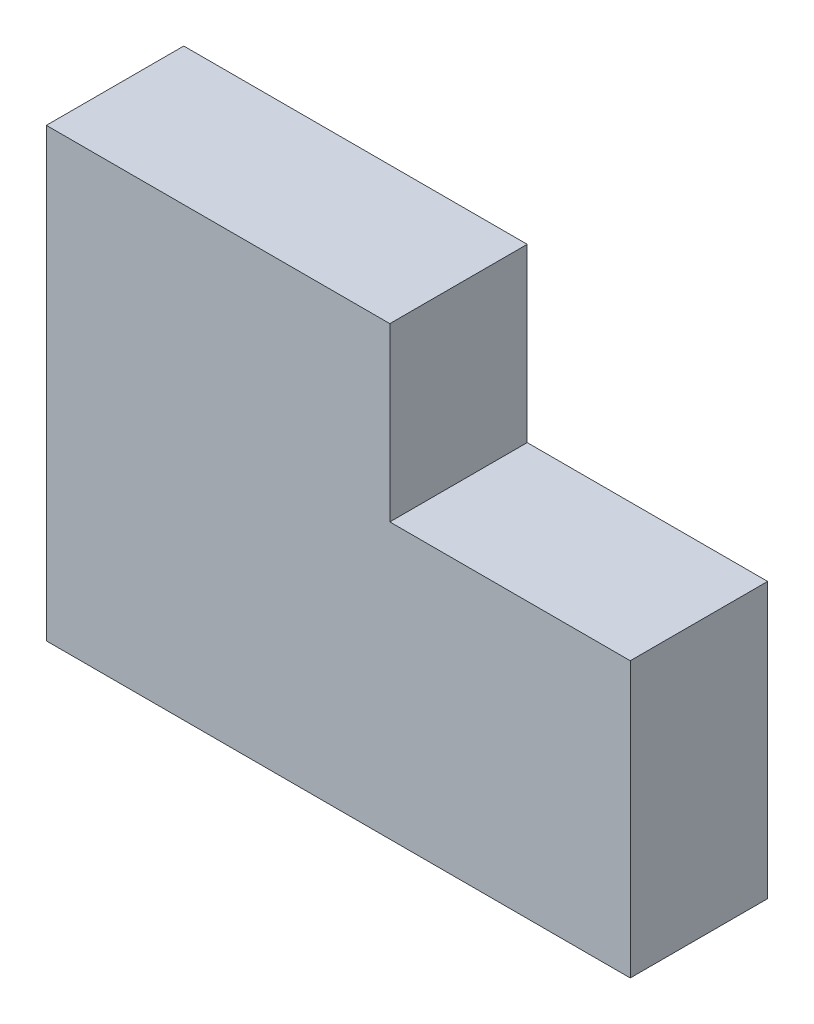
ISO-10303-21;
HEADER;
FILE_DESCRIPTION(('STEP AP214'),'2;1');
FILE_NAME('part.step','',(''),(''),'','','');
FILE_SCHEMA(('AUTOMOTIVE_DESIGN { 1 0 10303 214 1 1 1 1 }'));
ENDSEC;
DATA;
#1=APPLICATION_CONTEXT('core data for automotive mechanical design processes');
#2=APPLICATION_PROTOCOL_DEFINITION('international standard','automotive_design',2000,#1);
#3=PRODUCT_CONTEXT('',#1,'mechanical');
#4=PRODUCT('Part','Part','',(#3));
#5=PRODUCT_RELATED_PRODUCT_CATEGORY('part','',(#4));
#6=PRODUCT_DEFINITION_FORMATION('','',#4);
#7=PRODUCT_DEFINITION_CONTEXT('part definition',#1,'design');
#8=PRODUCT_DEFINITION('design','',#6,#7);
#9=PRODUCT_DEFINITION_SHAPE('','',#8);
#10=(LENGTH_UNIT() NAMED_UNIT(*) SI_UNIT(.MILLI.,.METRE.));
#11=(NAMED_UNIT(*) PLANE_ANGLE_UNIT() SI_UNIT($,.RADIAN.));
#12=(NAMED_UNIT(*) SI_UNIT($,.STERADIAN.) SOLID_ANGLE_UNIT());
#13=UNCERTAINTY_MEASURE_WITH_UNIT(LENGTH_MEASURE(1.E-05),#10,'distance_accuracy_value','');
#14=(GEOMETRIC_REPRESENTATION_CONTEXT(3) GLOBAL_UNCERTAINTY_ASSIGNED_CONTEXT((#13)) GLOBAL_UNIT_ASSIGNED_CONTEXT((#10,
#11,#12)) REPRESENTATION_CONTEXT('',''));
#15=CARTESIAN_POINT('',(0.,0.,0.));
#16=DIRECTION('',(0.,0.,1.));
#17=DIRECTION('',(1.,0.,0.));
#18=AXIS2_PLACEMENT_3D('',#15,#16,#17);
#19=CARTESIAN_POINT('',(0.,65.,20.));
#20=DIRECTION('',(1.,0.,0.));
#21=DIRECTION('',(0.,1.,0.));
#22=AXIS2_PLACEMENT_3D('',#19,#20,#21);
#23=PLANE('',#22);
#24=DIRECTION('',(0.,-1.,0.));
#25=VECTOR('',#24,1.);
#26=CARTESIAN_POINT('',(0.,65.,0.));
#27=LINE('',#26,#25);
#28=CARTESIAN_POINT('',(0.,65.,0.));
#29=VERTEX_POINT('',#28);
#30=CARTESIAN_POINT('',(0.,0.,0.));
#31=VERTEX_POINT('',#30);
#32=EDGE_CURVE('E84',#29,#31,#27,.T.);
#33=ORIENTED_EDGE('',*,*,#32,.T.);
#34=DIRECTION('',(0.,0.,-1.));
#35=VECTOR('',#34,1.);
#36=CARTESIAN_POINT('',(0.,0.,20.));
#37=LINE('',#36,#35);
#38=CARTESIAN_POINT('',(0.,0.,20.));
#39=VERTEX_POINT('',#38);
#40=EDGE_CURVE('E11',#39,#31,#37,.T.);
#41=ORIENTED_EDGE('',*,*,#40,.F.);
#42=DIRECTION('',(0.,-1.,0.));
#43=VECTOR('',#42,1.);
#44=CARTESIAN_POINT('',(0.,65.,20.));
#45=LINE('',#44,#43);
#46=CARTESIAN_POINT('',(0.,65.,20.));
#47=VERTEX_POINT('',#46);
#48=EDGE_CURVE('E107',#47,#39,#45,.T.);
#49=ORIENTED_EDGE('',*,*,#48,.F.);
#50=DIRECTION('',(0.,0.,-1.));
#51=VECTOR('',#50,1.);
#52=CARTESIAN_POINT('',(0.,65.,20.));
#53=LINE('',#52,#51);
#54=EDGE_CURVE('E97',#47,#29,#53,.T.);
#55=ORIENTED_EDGE('',*,*,#54,.T.);
#56=EDGE_LOOP('',(#33,#41,#49,#55));
#57=FACE_BOUND('',#56,.T.);
#58=ADVANCED_FACE('F28',(#57),#23,.F.);
#59=CARTESIAN_POINT('',(0.,0.,20.));
#60=DIRECTION('',(0.,1.,0.));
#61=DIRECTION('',(0.,0.,1.));
#62=AXIS2_PLACEMENT_3D('',#59,#60,#61);
#63=PLANE('',#62);
#64=DIRECTION('',(1.,0.,0.));
#65=VECTOR('',#64,1.);
#66=CARTESIAN_POINT('',(0.,0.,0.));
#67=LINE('',#66,#65);
#68=CARTESIAN_POINT('',(85.,0.,0.));
#69=VERTEX_POINT('',#68);
#70=EDGE_CURVE('E80',#31,#69,#67,.T.);
#71=ORIENTED_EDGE('',*,*,#70,.T.);
#72=DIRECTION('',(0.,0.,-1.));
#73=VECTOR('',#72,1.);
#74=CARTESIAN_POINT('',(85.,0.,20.));
#75=LINE('',#74,#73);
#76=CARTESIAN_POINT('',(85.,0.,20.));
#77=VERTEX_POINT('',#76);
#78=EDGE_CURVE('E35',#77,#69,#75,.T.);
#79=ORIENTED_EDGE('',*,*,#78,.F.);
#80=DIRECTION('',(1.,0.,0.));
#81=VECTOR('',#80,1.);
#82=CARTESIAN_POINT('',(0.,0.,20.));
#83=LINE('',#82,#81);
#84=EDGE_CURVE('E93',#39,#77,#83,.T.);
#85=ORIENTED_EDGE('',*,*,#84,.F.);
#86=ORIENTED_EDGE('',*,*,#40,.T.);
#87=EDGE_LOOP('',(#71,#79,#85,#86));
#88=FACE_BOUND('',#87,.T.);
#89=ADVANCED_FACE('F92',(#88),#63,.F.);
#90=CARTESIAN_POINT('',(85.,0.,20.));
#91=DIRECTION('',(-1.,0.,0.));
#92=DIRECTION('',(0.,0.,1.));
#93=AXIS2_PLACEMENT_3D('',#90,#91,#92);
#94=PLANE('',#93);
#95=DIRECTION('',(0.,1.,0.));
#96=VECTOR('',#95,1.);
#97=CARTESIAN_POINT('',(85.,0.,0.));
#98=LINE('',#97,#96);
#99=CARTESIAN_POINT('',(85.,40.,0.));
#100=VERTEX_POINT('',#99);
#101=EDGE_CURVE('E86',#69,#100,#98,.T.);
#102=ORIENTED_EDGE('',*,*,#101,.T.);
#103=DIRECTION('',(0.,0.,-1.));
#104=VECTOR('',#103,1.);
#105=CARTESIAN_POINT('',(85.,40.,20.));
#106=LINE('',#105,#104);
#107=CARTESIAN_POINT('',(85.,40.,20.));
#108=VERTEX_POINT('',#107);
#109=EDGE_CURVE('E123',#108,#100,#106,.T.);
#110=ORIENTED_EDGE('',*,*,#109,.F.);
#111=DIRECTION('',(0.,1.,0.));
#112=VECTOR('',#111,1.);
#113=CARTESIAN_POINT('',(85.,0.,20.));
#114=LINE('',#113,#112);
#115=EDGE_CURVE('E110',#77,#108,#114,.T.);
#116=ORIENTED_EDGE('',*,*,#115,.F.);
#117=ORIENTED_EDGE('',*,*,#78,.T.);
#118=EDGE_LOOP('',(#102,#110,#116,#117));
#119=FACE_BOUND('',#118,.T.);
#120=ADVANCED_FACE('F127',(#119),#94,.F.);
#121=CARTESIAN_POINT('',(85.,40.,20.));
#122=DIRECTION('',(0.,-1.,0.));
#123=DIRECTION('',(1.,0.,0.));
#124=AXIS2_PLACEMENT_3D('',#121,#122,#123);
#125=PLANE('',#124);
#126=DIRECTION('',(-1.,0.,0.));
#127=VECTOR('',#126,1.);
#128=CARTESIAN_POINT('',(85.,40.,0.));
#129=LINE('',#128,#127);
#130=CARTESIAN_POINT('',(50.,40.,0.));
#131=VERTEX_POINT('',#130);
#132=EDGE_CURVE('E101',#100,#131,#129,.T.);
#133=ORIENTED_EDGE('',*,*,#132,.T.);
#134=DIRECTION('',(0.,0.,-1.));
#135=VECTOR('',#134,1.);
#136=CARTESIAN_POINT('',(50.,40.,20.));
#137=LINE('',#136,#135);
#138=CARTESIAN_POINT('',(50.,40.,20.));
#139=VERTEX_POINT('',#138);
#140=EDGE_CURVE('E120',#139,#131,#137,.T.);
#141=ORIENTED_EDGE('',*,*,#140,.F.);
#142=DIRECTION('',(-1.,0.,0.));
#143=VECTOR('',#142,1.);
#144=CARTESIAN_POINT('',(85.,40.,20.));
#145=LINE('',#144,#143);
#146=EDGE_CURVE('E112',#108,#139,#145,.T.);
#147=ORIENTED_EDGE('',*,*,#146,.F.);
#148=ORIENTED_EDGE('',*,*,#109,.T.);
#149=EDGE_LOOP('',(#133,#141,#147,#148));
#150=FACE_BOUND('',#149,.T.);
#151=ADVANCED_FACE('F133',(#150),#125,.F.);
#152=CARTESIAN_POINT('',(50.,40.,20.));
#153=DIRECTION('',(-1.,0.,0.));
#154=DIRECTION('',(0.,0.,1.));
#155=AXIS2_PLACEMENT_3D('',#152,#153,#154);
#156=PLANE('',#155);
#157=DIRECTION('',(0.,1.,0.));
#158=VECTOR('',#157,1.);
#159=CARTESIAN_POINT('',(50.,40.,0.));
#160=LINE('',#159,#158);
#161=CARTESIAN_POINT('',(50.,65.,0.));
#162=VERTEX_POINT('',#161);
#163=EDGE_CURVE('E103',#131,#162,#160,.T.);
#164=ORIENTED_EDGE('',*,*,#163,.T.);
#165=DIRECTION('',(0.,0.,-1.));
#166=VECTOR('',#165,1.);
#167=CARTESIAN_POINT('',(50.,65.,20.));
#168=LINE('',#167,#166);
#169=CARTESIAN_POINT('',(50.,65.,20.));
#170=VERTEX_POINT('',#169);
#171=EDGE_CURVE('E117',#170,#162,#168,.T.);
#172=ORIENTED_EDGE('',*,*,#171,.F.);
#173=DIRECTION('',(0.,1.,0.));
#174=VECTOR('',#173,1.);
#175=CARTESIAN_POINT('',(50.,40.,20.));
#176=LINE('',#175,#174);
#177=EDGE_CURVE('E47',#139,#170,#176,.T.);
#178=ORIENTED_EDGE('',*,*,#177,.F.);
#179=ORIENTED_EDGE('',*,*,#140,.T.);
#180=EDGE_LOOP('',(#164,#172,#178,#179));
#181=FACE_BOUND('',#180,.T.);
#182=ADVANCED_FACE('F136',(#181),#156,.F.);
#183=CARTESIAN_POINT('',(50.,65.,20.));
#184=DIRECTION('',(0.,-1.,0.));
#185=DIRECTION('',(1.,0.,0.));
#186=AXIS2_PLACEMENT_3D('',#183,#184,#185);
#187=PLANE('',#186);
#188=DIRECTION('',(-1.,0.,0.));
#189=VECTOR('',#188,1.);
#190=CARTESIAN_POINT('',(50.,65.,0.));
#191=LINE('',#190,#189);
#192=EDGE_CURVE('E105',#162,#29,#191,.T.);
#193=ORIENTED_EDGE('',*,*,#192,.T.);
#194=ORIENTED_EDGE('',*,*,#54,.F.);
#195=DIRECTION('',(-1.,0.,0.));
#196=VECTOR('',#195,1.);
#197=CARTESIAN_POINT('',(50.,65.,20.));
#198=LINE('',#197,#196);
#199=EDGE_CURVE('E42',#170,#47,#198,.T.);
#200=ORIENTED_EDGE('',*,*,#199,.F.);
#201=ORIENTED_EDGE('',*,*,#171,.T.);
#202=EDGE_LOOP('',(#193,#194,#200,#201));
#203=FACE_BOUND('',#202,.T.);
#204=ADVANCED_FACE('F138',(#203),#187,.F.);
#205=CARTESIAN_POINT('',(0.,0.,20.));
#206=DIRECTION('',(0.,0.,1.));
#207=DIRECTION('',(1.,0.,0.));
#208=AXIS2_PLACEMENT_3D('',#205,#206,#207);
#209=PLANE('',#208);
#210=ORIENTED_EDGE('',*,*,#48,.T.);
#211=ORIENTED_EDGE('',*,*,#84,.T.);
#212=ORIENTED_EDGE('',*,*,#115,.T.);
#213=ORIENTED_EDGE('',*,*,#146,.T.);
#214=ORIENTED_EDGE('',*,*,#177,.T.);
#215=ORIENTED_EDGE('',*,*,#199,.T.);
#216=EDGE_LOOP('',(#210,#211,#212,#213,#214,#215));
#217=FACE_BOUND('',#216,.T.);
#218=ADVANCED_FACE('F130',(#217),#209,.T.);
#219=CARTESIAN_POINT('',(0.,0.,0.));
#220=DIRECTION('',(0.,0.,1.));
#221=DIRECTION('',(1.,0.,0.));
#222=AXIS2_PLACEMENT_3D('',#219,#220,#221);
#223=PLANE('',#222);
#224=ORIENTED_EDGE('',*,*,#32,.F.);
#225=ORIENTED_EDGE('',*,*,#192,.F.);
#226=ORIENTED_EDGE('',*,*,#163,.F.);
#227=ORIENTED_EDGE('',*,*,#132,.F.);
#228=ORIENTED_EDGE('',*,*,#101,.F.);
#229=ORIENTED_EDGE('',*,*,#70,.F.);
#230=EDGE_LOOP('',(#224,#225,#226,#227,#228,#229));
#231=FACE_BOUND('',#230,.T.);
#232=ADVANCED_FACE('F81',(#231),#223,.F.);
#233=CLOSED_SHELL('',(#58,#89,#120,#151,#182,#204,#218,#232));
#234=MANIFOLD_SOLID_BREP('B2',#233);
#235=ADVANCED_BREP_SHAPE_REPRESENTATION('',(#18,#234),#14);
#236=SHAPE_DEFINITION_REPRESENTATION(#9,#235);
ENDSEC;
END-ISO-10303-21;
